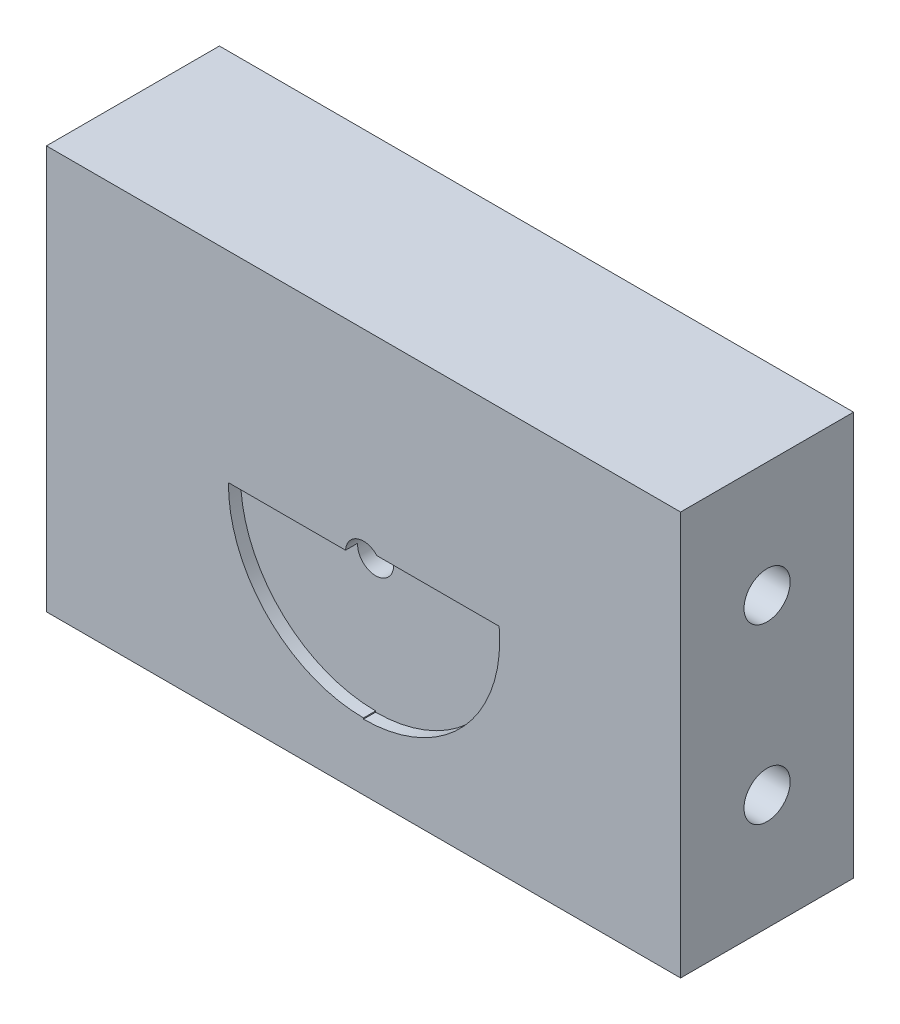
ISO-10303-21;
HEADER;
FILE_DESCRIPTION(('STEP AP214'),'2;1');
FILE_NAME('part.step','',(''),(''),'','','');
FILE_SCHEMA(('AUTOMOTIVE_DESIGN { 1 0 10303 214 1 1 1 1 }'));
ENDSEC;
DATA;
#1=APPLICATION_CONTEXT('core data for automotive mechanical design processes');
#2=APPLICATION_PROTOCOL_DEFINITION('international standard','automotive_design',2000,#1);
#3=PRODUCT_CONTEXT('',#1,'mechanical');
#4=PRODUCT('Part','Part','',(#3));
#5=PRODUCT_RELATED_PRODUCT_CATEGORY('part','',(#4));
#6=PRODUCT_DEFINITION_FORMATION('','',#4);
#7=PRODUCT_DEFINITION_CONTEXT('part definition',#1,'design');
#8=PRODUCT_DEFINITION('design','',#6,#7);
#9=PRODUCT_DEFINITION_SHAPE('','',#8);
#10=(LENGTH_UNIT() NAMED_UNIT(*) SI_UNIT(.MILLI.,.METRE.));
#11=(NAMED_UNIT(*) PLANE_ANGLE_UNIT() SI_UNIT($,.RADIAN.));
#12=(NAMED_UNIT(*) SI_UNIT($,.STERADIAN.) SOLID_ANGLE_UNIT());
#13=UNCERTAINTY_MEASURE_WITH_UNIT(LENGTH_MEASURE(1.E-05),#10,'distance_accuracy_value','');
#14=(GEOMETRIC_REPRESENTATION_CONTEXT(3) GLOBAL_UNCERTAINTY_ASSIGNED_CONTEXT((#13)) GLOBAL_UNIT_ASSIGNED_CONTEXT((#10,
#11,#12)) REPRESENTATION_CONTEXT('',''));
#15=CARTESIAN_POINT('',(0.,0.,0.));
#16=DIRECTION('',(0.,0.,1.));
#17=DIRECTION('',(1.,0.,0.));
#18=AXIS2_PLACEMENT_3D('',#15,#16,#17);
#19=CARTESIAN_POINT('',(0.360795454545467,0.,-6.35));
#20=DIRECTION('',(0.,0.,1.));
#21=DIRECTION('',(1.,0.,0.));
#22=AXIS2_PLACEMENT_3D('',#19,#20,#21);
#23=PLANE('',#22);
#24=CARTESIAN_POINT('',(0.,0.,-6.35000000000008));
#25=DIRECTION('',(0.,0.,-1.));
#26=DIRECTION('',(-1.,0.,0.));
#27=AXIS2_PLACEMENT_3D('',#24,#25,#26);
#28=CIRCLE('',#27,3.96875000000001);
#29=CARTESIAN_POINT('',(-3.96875000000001,0.,-6.35000000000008));
#30=VERTEX_POINT('',#29);
#31=EDGE_CURVE('E152',#30,#30,#28,.F.);
#32=ORIENTED_EDGE('',*,*,#31,.T.);
#33=EDGE_LOOP('',(#32));
#34=FACE_BOUND('',#33,.T.);
#35=ADVANCED_FACE('F33',(#34),#23,.T.);
#36=CARTESIAN_POINT('',(-67.31,0.386772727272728,7.62));
#37=DIRECTION('',(1.,0.,0.));
#38=DIRECTION('',(0.,0.,-1.));
#39=AXIS2_PLACEMENT_3D('',#36,#37,#38);
#40=PLANE('',#39);
#41=CARTESIAN_POINT('',(-67.31,0.,7.62));
#42=DIRECTION('',(1.,0.,0.));
#43=DIRECTION('',(0.,0.,-1.));
#44=AXIS2_PLACEMENT_3D('',#41,#42,#43);
#45=CIRCLE('',#44,4.25450000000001);
#46=CARTESIAN_POINT('',(-67.31,0.,3.36549999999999));
#47=VERTEX_POINT('',#46);
#48=EDGE_CURVE('E290',#47,#47,#45,.F.);
#49=ORIENTED_EDGE('',*,*,#48,.T.);
#50=EDGE_LOOP('',(#49));
#51=FACE_BOUND('',#50,.T.);
#52=ADVANCED_FACE('F319',(#51),#40,.F.);
#53=CARTESIAN_POINT('',(-65.278,-9.80209090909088,0.));
#54=DIRECTION('',(1.,0.,0.));
#55=DIRECTION('',(0.,0.,-1.));
#56=AXIS2_PLACEMENT_3D('',#53,#54,#55);
#57=PLANE('',#56);
#58=CARTESIAN_POINT('',(-65.278,-10.16,0.));
#59=DIRECTION('',(1.,0.,0.));
#60=DIRECTION('',(0.,0.,-1.));
#61=AXIS2_PLACEMENT_3D('',#58,#59,#60);
#62=CIRCLE('',#61,3.93700000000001);
#63=CARTESIAN_POINT('',(-65.278,-10.16,-3.93700000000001));
#64=VERTEX_POINT('',#63);
#65=EDGE_CURVE('E287',#64,#64,#62,.F.);
#66=ORIENTED_EDGE('',*,*,#65,.T.);
#67=EDGE_LOOP('',(#66));
#68=FACE_BOUND('',#67,.T.);
#69=ADVANCED_FACE('F324',(#68),#57,.F.);
#70=CARTESIAN_POINT('',(-65.278,10.5179090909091,0.));
#71=DIRECTION('',(1.,0.,0.));
#72=DIRECTION('',(0.,0.,-1.));
#73=AXIS2_PLACEMENT_3D('',#70,#71,#72);
#74=PLANE('',#73);
#75=CARTESIAN_POINT('',(-65.278,10.16,0.));
#76=DIRECTION('',(1.,0.,0.));
#77=DIRECTION('',(0.,0.,-1.));
#78=AXIS2_PLACEMENT_3D('',#75,#76,#77);
#79=CIRCLE('',#78,3.93700000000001);
#80=CARTESIAN_POINT('',(-65.278,10.16,-3.93700000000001));
#81=VERTEX_POINT('',#80);
#82=EDGE_CURVE('E284',#81,#81,#79,.F.);
#83=ORIENTED_EDGE('',*,*,#82,.T.);
#84=EDGE_LOOP('',(#83));
#85=FACE_BOUND('',#84,.T.);
#86=ADVANCED_FACE('F729',(#85),#74,.F.);
#87=CARTESIAN_POINT('',(-67.31,0.386772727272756,-7.62));
#88=DIRECTION('',(1.,0.,0.));
#89=DIRECTION('',(0.,0.,-1.));
#90=AXIS2_PLACEMENT_3D('',#87,#88,#89);
#91=PLANE('',#90);
#92=CARTESIAN_POINT('',(-67.31,0.,-7.62));
#93=DIRECTION('',(1.,0.,0.));
#94=DIRECTION('',(0.,0.,-1.));
#95=AXIS2_PLACEMENT_3D('',#92,#93,#94);
#96=CIRCLE('',#95,4.25450000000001);
#97=CARTESIAN_POINT('',(-67.31,0.,-11.8745));
#98=VERTEX_POINT('',#97);
#99=EDGE_CURVE('E281',#98,#98,#96,.F.);
#100=ORIENTED_EDGE('',*,*,#99,.T.);
#101=EDGE_LOOP('',(#100));
#102=FACE_BOUND('',#101,.T.);
#103=ADVANCED_FACE('F720',(#102),#91,.F.);
#104=CARTESIAN_POINT('',(-67.31,-39.3007272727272,5.08000000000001));
#105=DIRECTION('',(1.,0.,0.));
#106=DIRECTION('',(0.,0.,-1.));
#107=AXIS2_PLACEMENT_3D('',#104,#105,#106);
#108=PLANE('',#107);
#109=CARTESIAN_POINT('',(-67.31,-39.6875,5.08000000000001));
#110=DIRECTION('',(1.,0.,0.));
#111=DIRECTION('',(0.,0.,-1.));
#112=AXIS2_PLACEMENT_3D('',#109,#110,#111);
#113=CIRCLE('',#112,4.25450000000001);
#114=CARTESIAN_POINT('',(-67.31,-39.6875,0.825500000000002));
#115=VERTEX_POINT('',#114);
#116=EDGE_CURVE('E278',#115,#115,#113,.F.);
#117=ORIENTED_EDGE('',*,*,#116,.T.);
#118=EDGE_LOOP('',(#117));
#119=FACE_BOUND('',#118,.T.);
#120=ADVANCED_FACE('F621',(#119),#108,.F.);
#121=CARTESIAN_POINT('',(-67.31,40.0742727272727,5.08000000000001));
#122=DIRECTION('',(1.,0.,0.));
#123=DIRECTION('',(0.,0.,-1.));
#124=AXIS2_PLACEMENT_3D('',#121,#122,#123);
#125=PLANE('',#124);
#126=CARTESIAN_POINT('',(-67.31,39.6875,5.08000000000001));
#127=DIRECTION('',(1.,0.,0.));
#128=DIRECTION('',(0.,0.,-1.));
#129=AXIS2_PLACEMENT_3D('',#126,#127,#128);
#130=CIRCLE('',#129,4.25450000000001);
#131=CARTESIAN_POINT('',(-67.31,39.6875,0.825500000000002));
#132=VERTEX_POINT('',#131);
#133=EDGE_CURVE('E275',#132,#132,#130,.F.);
#134=ORIENTED_EDGE('',*,*,#133,.T.);
#135=EDGE_LOOP('',(#134));
#136=FACE_BOUND('',#135,.T.);
#137=ADVANCED_FACE('F603',(#136),#125,.F.);
#138=CARTESIAN_POINT('',(-67.31,40.0742727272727,-5.08));
#139=DIRECTION('',(1.,0.,0.));
#140=DIRECTION('',(0.,0.,-1.));
#141=AXIS2_PLACEMENT_3D('',#138,#139,#140);
#142=PLANE('',#141);
#143=CARTESIAN_POINT('',(-67.31,39.6875,-5.08));
#144=DIRECTION('',(1.,0.,0.));
#145=DIRECTION('',(0.,0.,-1.));
#146=AXIS2_PLACEMENT_3D('',#143,#144,#145);
#147=CIRCLE('',#146,4.25450000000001);
#148=CARTESIAN_POINT('',(-67.31,39.6875,-9.33450000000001));
#149=VERTEX_POINT('',#148);
#150=EDGE_CURVE('E272',#149,#149,#147,.F.);
#151=ORIENTED_EDGE('',*,*,#150,.T.);
#152=EDGE_LOOP('',(#151));
#153=FACE_BOUND('',#152,.T.);
#154=ADVANCED_FACE('F598',(#153),#142,.F.);
#155=CARTESIAN_POINT('',(-67.31,-39.3007272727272,-5.08));
#156=DIRECTION('',(1.,0.,0.));
#157=DIRECTION('',(0.,0.,-1.));
#158=AXIS2_PLACEMENT_3D('',#155,#156,#157);
#159=PLANE('',#158);
#160=CARTESIAN_POINT('',(-67.31,-39.6875,-5.08));
#161=DIRECTION('',(1.,0.,0.));
#162=DIRECTION('',(0.,0.,-1.));
#163=AXIS2_PLACEMENT_3D('',#160,#161,#162);
#164=CIRCLE('',#163,4.25450000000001);
#165=CARTESIAN_POINT('',(-67.31,-39.6875,-9.33450000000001));
#166=VERTEX_POINT('',#165);
#167=EDGE_CURVE('E269',#166,#166,#164,.F.);
#168=ORIENTED_EDGE('',*,*,#167,.T.);
#169=EDGE_LOOP('',(#168));
#170=FACE_BOUND('',#169,.T.);
#171=ADVANCED_FACE('F348',(#170),#159,.F.);
#172=CARTESIAN_POINT('',(-66.802,-27.94,5.1816));
#173=DIRECTION('',(1.,0.,0.));
#174=DIRECTION('',(0.,0.,-1.));
#175=AXIS2_PLACEMENT_3D('',#172,#173,#174);
#176=PLANE('',#175);
#177=CARTESIAN_POINT('',(-66.802,-22.86,0.));
#178=DIRECTION('',(1.,0.,0.));
#179=DIRECTION('',(0.,0.,-1.));
#180=AXIS2_PLACEMENT_3D('',#177,#178,#179);
#181=CIRCLE('',#180,5.08);
#182=CARTESIAN_POINT('',(-66.802,-22.86,-5.08));
#183=VERTEX_POINT('',#182);
#184=EDGE_CURVE('E266',#183,#183,#181,.F.);
#185=ORIENTED_EDGE('',*,*,#184,.T.);
#186=EDGE_LOOP('',(#185));
#187=FACE_BOUND('',#186,.T.);
#188=ADVANCED_FACE('F345',(#187),#176,.F.);
#189=CARTESIAN_POINT('',(-66.802,23.3218181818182,0.));
#190=DIRECTION('',(1.,0.,0.));
#191=DIRECTION('',(0.,0.,-1.));
#192=AXIS2_PLACEMENT_3D('',#189,#190,#191);
#193=PLANE('',#192);
#194=CARTESIAN_POINT('',(-66.802,22.86,0.));
#195=DIRECTION('',(1.,0.,0.));
#196=DIRECTION('',(0.,0.,-1.));
#197=AXIS2_PLACEMENT_3D('',#194,#195,#196);
#198=CIRCLE('',#197,5.08);
#199=CARTESIAN_POINT('',(-66.802,22.86,-5.08));
#200=VERTEX_POINT('',#199);
#201=EDGE_CURVE('E263',#200,#200,#198,.F.);
#202=ORIENTED_EDGE('',*,*,#201,.T.);
#203=EDGE_LOOP('',(#202));
#204=FACE_BOUND('',#203,.T.);
#205=ADVANCED_FACE('F314',(#204),#193,.F.);
#206=CARTESIAN_POINT('',(0.,0.,19.05));
#207=DIRECTION('',(0.,0.,-1.));
#208=DIRECTION('',(-1.,0.,0.));
#209=AXIS2_PLACEMENT_3D('',#206,#207,#208);
#210=CYLINDRICAL_SURFACE('',#209,3.96875000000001);
#211=CARTESIAN_POINT('',(0.,0.,19.05));
#212=DIRECTION('',(0.,0.,-1.));
#213=DIRECTION('',(-1.,0.,0.));
#214=AXIS2_PLACEMENT_3D('',#211,#212,#213);
#215=CIRCLE('',#214,3.96875000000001);
#216=CARTESIAN_POINT('',(-3.96061365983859,0.253999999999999,19.05));
#217=VERTEX_POINT('',#216);
#218=CARTESIAN_POINT('',(2.93906236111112,2.667,19.05));
#219=VERTEX_POINT('',#218);
#220=EDGE_CURVE('E261',#217,#219,#215,.T.);
#221=ORIENTED_EDGE('',*,*,#220,.F.);
#222=DIRECTION('',(0.,0.,-1.));
#223=VECTOR('',#222,1.);
#224=CARTESIAN_POINT('',(-3.96061365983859,0.253999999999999,19.05));
#225=LINE('',#224,#223);
#226=CARTESIAN_POINT('',(-3.96061365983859,0.253999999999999,16.383));
#227=VERTEX_POINT('',#226);
#228=EDGE_CURVE('E125',#217,#227,#225,.T.);
#229=ORIENTED_EDGE('',*,*,#228,.T.);
#230=CARTESIAN_POINT('',(0.,0.,16.383));
#231=DIRECTION('',(0.,0.,1.));
#232=DIRECTION('',(1.,0.,0.));
#233=AXIS2_PLACEMENT_3D('',#230,#231,#232);
#234=CIRCLE('',#233,3.96875000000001);
#235=CARTESIAN_POINT('',(2.93906236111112,2.667,16.383));
#236=VERTEX_POINT('',#235);
#237=EDGE_CURVE('E41',#236,#227,#234,.F.);
#238=ORIENTED_EDGE('',*,*,#237,.F.);
#239=DIRECTION('',(0.,0.,-1.));
#240=VECTOR('',#239,1.);
#241=CARTESIAN_POINT('',(2.93906236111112,2.667,19.05));
#242=LINE('',#241,#240);
#243=EDGE_CURVE('E148',#236,#219,#242,.F.);
#244=ORIENTED_EDGE('',*,*,#243,.T.);
#245=EDGE_LOOP('',(#221,#229,#238,#244));
#246=FACE_BOUND('',#245,.T.);
#247=ORIENTED_EDGE('',*,*,#31,.F.);
#248=EDGE_LOOP('',(#247));
#249=FACE_BOUND('',#248,.T.);
#250=ADVANCED_FACE('F310',(#246,#249),#210,.F.);
#251=CARTESIAN_POINT('',(39.116,13.97,5.1816));
#252=DIRECTION('',(1.,0.,0.));
#253=DIRECTION('',(0.,0.,-1.));
#254=AXIS2_PLACEMENT_3D('',#251,#252,#253);
#255=PLANE('',#254);
#256=CARTESIAN_POINT('',(39.116,19.05,0.));
#257=DIRECTION('',(-1.,0.,0.));
#258=DIRECTION('',(0.,0.,1.));
#259=AXIS2_PLACEMENT_3D('',#256,#257,#258);
#260=CIRCLE('',#259,5.08);
#261=CARTESIAN_POINT('',(39.116,19.05,5.08));
#262=VERTEX_POINT('',#261);
#263=EDGE_CURVE('E258',#262,#262,#260,.F.);
#264=ORIENTED_EDGE('',*,*,#263,.T.);
#265=EDGE_LOOP('',(#264));
#266=FACE_BOUND('',#265,.T.);
#267=ADVANCED_FACE('F313',(#266),#255,.T.);
#268=CARTESIAN_POINT('',(39.116,-18.5881818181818,0.));
#269=DIRECTION('',(1.,0.,0.));
#270=DIRECTION('',(0.,0.,-1.));
#271=AXIS2_PLACEMENT_3D('',#268,#269,#270);
#272=PLANE('',#271);
#273=CARTESIAN_POINT('',(39.116,-19.05,0.));
#274=DIRECTION('',(-1.,0.,0.));
#275=DIRECTION('',(0.,0.,1.));
#276=AXIS2_PLACEMENT_3D('',#273,#274,#275);
#277=CIRCLE('',#276,5.08);
#278=CARTESIAN_POINT('',(39.116,-19.05,5.08));
#279=VERTEX_POINT('',#278);
#280=EDGE_CURVE('E156',#279,#279,#277,.F.);
#281=ORIENTED_EDGE('',*,*,#280,.T.);
#282=EDGE_LOOP('',(#281));
#283=FACE_BOUND('',#282,.T.);
#284=ADVANCED_FACE('F351',(#283),#272,.T.);
#285=CARTESIAN_POINT('',(-69.85,0.,7.62));
#286=DIRECTION('',(1.,0.,0.));
#287=DIRECTION('',(0.,0.,-1.));
#288=AXIS2_PLACEMENT_3D('',#285,#286,#287);
#289=CYLINDRICAL_SURFACE('',#288,4.25450000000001);
#290=CARTESIAN_POINT('',(-69.85,0.,7.62));
#291=DIRECTION('',(1.,0.,0.));
#292=DIRECTION('',(0.,0.,-1.));
#293=AXIS2_PLACEMENT_3D('',#290,#291,#292);
#294=CIRCLE('',#293,4.25450000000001);
#295=CARTESIAN_POINT('',(-69.85,0.,3.36549999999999));
#296=VERTEX_POINT('',#295);
#297=EDGE_CURVE('E159',#296,#296,#294,.T.);
#298=ORIENTED_EDGE('',*,*,#297,.F.);
#299=EDGE_LOOP('',(#298));
#300=FACE_BOUND('',#299,.T.);
#301=ORIENTED_EDGE('',*,*,#48,.F.);
#302=EDGE_LOOP('',(#301));
#303=FACE_BOUND('',#302,.T.);
#304=ADVANCED_FACE('F522',(#300,#303),#289,.F.);
#305=CARTESIAN_POINT('',(-69.85,-10.16,0.));
#306=DIRECTION('',(1.,0.,0.));
#307=DIRECTION('',(0.,0.,-1.));
#308=AXIS2_PLACEMENT_3D('',#305,#306,#307);
#309=CYLINDRICAL_SURFACE('',#308,3.93700000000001);
#310=CARTESIAN_POINT('',(-69.85,-10.16,0.));
#311=DIRECTION('',(1.,0.,0.));
#312=DIRECTION('',(0.,0.,-1.));
#313=AXIS2_PLACEMENT_3D('',#310,#311,#312);
#314=CIRCLE('',#313,3.93700000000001);
#315=CARTESIAN_POINT('',(-69.85,-10.16,-3.93700000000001));
#316=VERTEX_POINT('',#315);
#317=EDGE_CURVE('E251',#316,#316,#314,.T.);
#318=ORIENTED_EDGE('',*,*,#317,.F.);
#319=EDGE_LOOP('',(#318));
#320=FACE_BOUND('',#319,.T.);
#321=ORIENTED_EDGE('',*,*,#65,.F.);
#322=EDGE_LOOP('',(#321));
#323=FACE_BOUND('',#322,.T.);
#324=ADVANCED_FACE('F527',(#320,#323),#309,.F.);
#325=CARTESIAN_POINT('',(-69.85,10.16,0.));
#326=DIRECTION('',(1.,0.,0.));
#327=DIRECTION('',(0.,0.,-1.));
#328=AXIS2_PLACEMENT_3D('',#325,#326,#327);
#329=CYLINDRICAL_SURFACE('',#328,3.93700000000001);
#330=CARTESIAN_POINT('',(-69.85,10.16,0.));
#331=DIRECTION('',(1.,0.,0.));
#332=DIRECTION('',(0.,0.,-1.));
#333=AXIS2_PLACEMENT_3D('',#330,#331,#332);
#334=CIRCLE('',#333,3.93700000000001);
#335=CARTESIAN_POINT('',(-69.85,10.16,-3.93700000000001));
#336=VERTEX_POINT('',#335);
#337=EDGE_CURVE('E248',#336,#336,#334,.T.);
#338=ORIENTED_EDGE('',*,*,#337,.F.);
#339=EDGE_LOOP('',(#338));
#340=FACE_BOUND('',#339,.T.);
#341=ORIENTED_EDGE('',*,*,#82,.F.);
#342=EDGE_LOOP('',(#341));
#343=FACE_BOUND('',#342,.T.);
#344=ADVANCED_FACE('F537',(#340,#343),#329,.F.);
#345=CARTESIAN_POINT('',(-69.85,0.,-7.62));
#346=DIRECTION('',(1.,0.,0.));
#347=DIRECTION('',(0.,0.,-1.));
#348=AXIS2_PLACEMENT_3D('',#345,#346,#347);
#349=CYLINDRICAL_SURFACE('',#348,4.25450000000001);
#350=CARTESIAN_POINT('',(-69.85,0.,-7.62));
#351=DIRECTION('',(1.,0.,0.));
#352=DIRECTION('',(0.,0.,-1.));
#353=AXIS2_PLACEMENT_3D('',#350,#351,#352);
#354=CIRCLE('',#353,4.25450000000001);
#355=CARTESIAN_POINT('',(-69.85,0.,-11.8745));
#356=VERTEX_POINT('',#355);
#357=EDGE_CURVE('E245',#356,#356,#354,.T.);
#358=ORIENTED_EDGE('',*,*,#357,.F.);
#359=EDGE_LOOP('',(#358));
#360=FACE_BOUND('',#359,.T.);
#361=ORIENTED_EDGE('',*,*,#99,.F.);
#362=EDGE_LOOP('',(#361));
#363=FACE_BOUND('',#362,.T.);
#364=ADVANCED_FACE('F555',(#360,#363),#349,.F.);
#365=CARTESIAN_POINT('',(-69.85,-39.6875,5.08000000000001));
#366=DIRECTION('',(1.,0.,0.));
#367=DIRECTION('',(0.,0.,-1.));
#368=AXIS2_PLACEMENT_3D('',#365,#366,#367);
#369=CYLINDRICAL_SURFACE('',#368,4.25450000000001);
#370=CARTESIAN_POINT('',(-69.85,-39.6875,5.08000000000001));
#371=DIRECTION('',(1.,0.,0.));
#372=DIRECTION('',(0.,0.,-1.));
#373=AXIS2_PLACEMENT_3D('',#370,#371,#372);
#374=CIRCLE('',#373,4.25450000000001);
#375=CARTESIAN_POINT('',(-69.85,-39.6875,0.825500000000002));
#376=VERTEX_POINT('',#375);
#377=EDGE_CURVE('E242',#376,#376,#374,.T.);
#378=ORIENTED_EDGE('',*,*,#377,.F.);
#379=EDGE_LOOP('',(#378));
#380=FACE_BOUND('',#379,.T.);
#381=ORIENTED_EDGE('',*,*,#116,.F.);
#382=EDGE_LOOP('',(#381));
#383=FACE_BOUND('',#382,.T.);
#384=ADVANCED_FACE('F565',(#380,#383),#369,.F.);
#385=CARTESIAN_POINT('',(-69.85,39.6875,5.08000000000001));
#386=DIRECTION('',(1.,0.,0.));
#387=DIRECTION('',(0.,0.,-1.));
#388=AXIS2_PLACEMENT_3D('',#385,#386,#387);
#389=CYLINDRICAL_SURFACE('',#388,4.25450000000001);
#390=CARTESIAN_POINT('',(-69.85,39.6875,5.08000000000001));
#391=DIRECTION('',(1.,0.,0.));
#392=DIRECTION('',(0.,0.,-1.));
#393=AXIS2_PLACEMENT_3D('',#390,#391,#392);
#394=CIRCLE('',#393,4.25450000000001);
#395=CARTESIAN_POINT('',(-69.85,39.6875,0.825500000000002));
#396=VERTEX_POINT('',#395);
#397=EDGE_CURVE('E239',#396,#396,#394,.T.);
#398=ORIENTED_EDGE('',*,*,#397,.F.);
#399=EDGE_LOOP('',(#398));
#400=FACE_BOUND('',#399,.T.);
#401=ORIENTED_EDGE('',*,*,#133,.F.);
#402=EDGE_LOOP('',(#401));
#403=FACE_BOUND('',#402,.T.);
#404=ADVANCED_FACE('F575',(#400,#403),#389,.F.);
#405=CARTESIAN_POINT('',(-69.85,39.6875,-5.08));
#406=DIRECTION('',(1.,0.,0.));
#407=DIRECTION('',(0.,0.,-1.));
#408=AXIS2_PLACEMENT_3D('',#405,#406,#407);
#409=CYLINDRICAL_SURFACE('',#408,4.25450000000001);
#410=CARTESIAN_POINT('',(-69.85,39.6875,-5.08));
#411=DIRECTION('',(1.,0.,0.));
#412=DIRECTION('',(0.,0.,-1.));
#413=AXIS2_PLACEMENT_3D('',#410,#411,#412);
#414=CIRCLE('',#413,4.25450000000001);
#415=CARTESIAN_POINT('',(-69.85,39.6875,-9.33450000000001));
#416=VERTEX_POINT('',#415);
#417=EDGE_CURVE('E236',#416,#416,#414,.T.);
#418=ORIENTED_EDGE('',*,*,#417,.F.);
#419=EDGE_LOOP('',(#418));
#420=FACE_BOUND('',#419,.T.);
#421=ORIENTED_EDGE('',*,*,#150,.F.);
#422=EDGE_LOOP('',(#421));
#423=FACE_BOUND('',#422,.T.);
#424=ADVANCED_FACE('F364',(#420,#423),#409,.F.);
#425=CARTESIAN_POINT('',(-69.85,-39.6875,-5.08));
#426=DIRECTION('',(1.,0.,0.));
#427=DIRECTION('',(0.,0.,-1.));
#428=AXIS2_PLACEMENT_3D('',#425,#426,#427);
#429=CYLINDRICAL_SURFACE('',#428,4.25450000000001);
#430=CARTESIAN_POINT('',(-69.85,-39.6875,-5.08));
#431=DIRECTION('',(1.,0.,0.));
#432=DIRECTION('',(0.,0.,-1.));
#433=AXIS2_PLACEMENT_3D('',#430,#431,#432);
#434=CIRCLE('',#433,4.25450000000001);
#435=CARTESIAN_POINT('',(-69.85,-39.6875,-9.33450000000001));
#436=VERTEX_POINT('',#435);
#437=EDGE_CURVE('E233',#436,#436,#434,.T.);
#438=ORIENTED_EDGE('',*,*,#437,.F.);
#439=EDGE_LOOP('',(#438));
#440=FACE_BOUND('',#439,.T.);
#441=ORIENTED_EDGE('',*,*,#167,.F.);
#442=EDGE_LOOP('',(#441));
#443=FACE_BOUND('',#442,.T.);
#444=ADVANCED_FACE('F356',(#440,#443),#429,.F.);
#445=CARTESIAN_POINT('',(-69.85,-22.86,0.));
#446=DIRECTION('',(1.,0.,0.));
#447=DIRECTION('',(0.,0.,-1.));
#448=AXIS2_PLACEMENT_3D('',#445,#446,#447);
#449=CYLINDRICAL_SURFACE('',#448,5.08);
#450=ORIENTED_EDGE('',*,*,#184,.F.);
#451=EDGE_LOOP('',(#450));
#452=FACE_BOUND('',#451,.T.);
#453=CARTESIAN_POINT('',(-69.85,-22.86,0.));
#454=DIRECTION('',(1.,0.,0.));
#455=DIRECTION('',(0.,0.,-1.));
#456=AXIS2_PLACEMENT_3D('',#453,#454,#455);
#457=CIRCLE('',#456,5.08);
#458=CARTESIAN_POINT('',(-69.85,-22.86,-5.08));
#459=VERTEX_POINT('',#458);
#460=EDGE_CURVE('E230',#459,#459,#457,.T.);
#461=ORIENTED_EDGE('',*,*,#460,.F.);
#462=EDGE_LOOP('',(#461));
#463=FACE_BOUND('',#462,.T.);
#464=ADVANCED_FACE('F353',(#452,#463),#449,.F.);
#465=CARTESIAN_POINT('',(-69.85,22.86,0.));
#466=DIRECTION('',(1.,0.,0.));
#467=DIRECTION('',(0.,0.,-1.));
#468=AXIS2_PLACEMENT_3D('',#465,#466,#467);
#469=CYLINDRICAL_SURFACE('',#468,5.08);
#470=ORIENTED_EDGE('',*,*,#201,.F.);
#471=EDGE_LOOP('',(#470));
#472=FACE_BOUND('',#471,.T.);
#473=CARTESIAN_POINT('',(-69.85,22.86,0.));
#474=DIRECTION('',(1.,0.,0.));
#475=DIRECTION('',(0.,0.,-1.));
#476=AXIS2_PLACEMENT_3D('',#473,#474,#475);
#477=CIRCLE('',#476,5.08);
#478=CARTESIAN_POINT('',(-69.85,22.86,-5.08));
#479=VERTEX_POINT('',#478);
#480=EDGE_CURVE('E166',#479,#479,#477,.T.);
#481=ORIENTED_EDGE('',*,*,#480,.F.);
#482=EDGE_LOOP('',(#481));
#483=FACE_BOUND('',#482,.T.);
#484=ADVANCED_FACE('F355',(#472,#483),#469,.F.);
#485=CARTESIAN_POINT('',(0.,0.,19.05));
#486=DIRECTION('',(0.,0.,1.));
#487=DIRECTION('',(1.,0.,0.));
#488=AXIS2_PLACEMENT_3D('',#485,#486,#487);
#489=PLANE('',#488);
#490=CARTESIAN_POINT('',(0.,0.,19.05));
#491=DIRECTION('',(0.,0.,1.));
#492=DIRECTION('',(1.,0.,0.));
#493=AXIS2_PLACEMENT_3D('',#490,#491,#492);
#494=CIRCLE('',#493,29.7560228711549);
#495=CARTESIAN_POINT('',(-29.7549387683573,0.253999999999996,19.05));
#496=VERTEX_POINT('',#495);
#497=CARTESIAN_POINT('',(0.,-29.7560228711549,19.05));
#498=VERTEX_POINT('',#497);
#499=EDGE_CURVE('E116',#496,#498,#494,.T.);
#500=ORIENTED_EDGE('',*,*,#499,.F.);
#501=DIRECTION('',(-1.,0.,0.));
#502=VECTOR('',#501,1.);
#503=CARTESIAN_POINT('',(2.93906236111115,0.254,19.05));
#504=LINE('',#503,#502);
#505=EDGE_CURVE('E122',#217,#496,#504,.T.);
#506=ORIENTED_EDGE('',*,*,#505,.F.);
#507=ORIENTED_EDGE('',*,*,#220,.T.);
#508=DIRECTION('',(-1.,0.,0.));
#509=VECTOR('',#508,1.);
#510=CARTESIAN_POINT('',(0.,2.667,19.05));
#511=LINE('',#510,#509);
#512=CARTESIAN_POINT('',(29.8812166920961,2.667,19.05));
#513=VERTEX_POINT('',#512);
#514=EDGE_CURVE('E138',#513,#219,#511,.T.);
#515=ORIENTED_EDGE('',*,*,#514,.F.);
#516=CARTESIAN_POINT('',(0.,0.,19.05));
#517=DIRECTION('',(0.,0.,1.));
#518=DIRECTION('',(1.,0.,0.));
#519=AXIS2_PLACEMENT_3D('',#516,#517,#518);
#520=CIRCLE('',#519,30.);
#521=CARTESIAN_POINT('',(0.,-30.,19.05));
#522=VERTEX_POINT('',#521);
#523=EDGE_CURVE('E56',#522,#513,#520,.T.);
#524=ORIENTED_EDGE('',*,*,#523,.F.);
#525=DIRECTION('',(0.,-1.,0.));
#526=VECTOR('',#525,1.);
#527=CARTESIAN_POINT('',(0.,0.,19.05));
#528=LINE('',#527,#526);
#529=EDGE_CURVE('E191',#498,#522,#528,.T.);
#530=ORIENTED_EDGE('',*,*,#529,.F.);
#531=EDGE_LOOP('',(#500,#506,#507,#515,#524,#530));
#532=FACE_BOUND('',#531,.T.);
#533=DIRECTION('',(0.,1.,0.));
#534=VECTOR('',#533,1.);
#535=CARTESIAN_POINT('',(69.85,44.45,19.05));
#536=LINE('',#535,#534);
#537=CARTESIAN_POINT('',(69.85,44.45,19.05));
#538=VERTEX_POINT('',#537);
#539=CARTESIAN_POINT('',(69.85,-44.45,19.05));
#540=VERTEX_POINT('',#539);
#541=EDGE_CURVE('E163',#538,#540,#536,.F.);
#542=ORIENTED_EDGE('',*,*,#541,.F.);
#543=DIRECTION('',(1.,0.,0.));
#544=VECTOR('',#543,1.);
#545=CARTESIAN_POINT('',(-69.85,44.45,19.05));
#546=LINE('',#545,#544);
#547=CARTESIAN_POINT('',(-69.85,44.45,19.05));
#548=VERTEX_POINT('',#547);
#549=EDGE_CURVE('E153',#548,#538,#546,.T.);
#550=ORIENTED_EDGE('',*,*,#549,.F.);
#551=DIRECTION('',(0.,1.,0.));
#552=VECTOR('',#551,1.);
#553=CARTESIAN_POINT('',(-69.85,-44.45,19.05));
#554=LINE('',#553,#552);
#555=CARTESIAN_POINT('',(-69.85,-44.45,19.05));
#556=VERTEX_POINT('',#555);
#557=EDGE_CURVE('E155',#556,#548,#554,.T.);
#558=ORIENTED_EDGE('',*,*,#557,.F.);
#559=DIRECTION('',(1.,0.,0.));
#560=VECTOR('',#559,1.);
#561=CARTESIAN_POINT('',(69.85,-44.45,19.05));
#562=LINE('',#561,#560);
#563=EDGE_CURVE('E164',#540,#556,#562,.F.);
#564=ORIENTED_EDGE('',*,*,#563,.F.);
#565=EDGE_LOOP('',(#542,#550,#558,#564));
#566=FACE_BOUND('',#565,.T.);
#567=ADVANCED_FACE('F303',(#532,#566),#489,.T.);
#568=CARTESIAN_POINT('',(69.85,19.05,0.));
#569=DIRECTION('',(-1.,0.,0.));
#570=DIRECTION('',(0.,0.,1.));
#571=AXIS2_PLACEMENT_3D('',#568,#569,#570);
#572=CYLINDRICAL_SURFACE('',#571,5.08);
#573=ORIENTED_EDGE('',*,*,#263,.F.);
#574=EDGE_LOOP('',(#573));
#575=FACE_BOUND('',#574,.T.);
#576=CARTESIAN_POINT('',(69.85,19.05,0.));
#577=DIRECTION('',(-1.,0.,0.));
#578=DIRECTION('',(0.,0.,1.));
#579=AXIS2_PLACEMENT_3D('',#576,#577,#578);
#580=CIRCLE('',#579,5.08);
#581=CARTESIAN_POINT('',(69.85,19.05,5.08));
#582=VERTEX_POINT('',#581);
#583=EDGE_CURVE('E170',#582,#582,#580,.T.);
#584=ORIENTED_EDGE('',*,*,#583,.F.);
#585=EDGE_LOOP('',(#584));
#586=FACE_BOUND('',#585,.T.);
#587=ADVANCED_FACE('F35',(#575,#586),#572,.F.);
#588=CARTESIAN_POINT('',(69.85,-19.05,0.));
#589=DIRECTION('',(-1.,0.,0.));
#590=DIRECTION('',(0.,0.,1.));
#591=AXIS2_PLACEMENT_3D('',#588,#589,#590);
#592=CYLINDRICAL_SURFACE('',#591,5.08);
#593=ORIENTED_EDGE('',*,*,#280,.F.);
#594=EDGE_LOOP('',(#593));
#595=FACE_BOUND('',#594,.T.);
#596=CARTESIAN_POINT('',(69.85,-19.05,0.));
#597=DIRECTION('',(-1.,0.,0.));
#598=DIRECTION('',(0.,0.,1.));
#599=AXIS2_PLACEMENT_3D('',#596,#597,#598);
#600=CIRCLE('',#599,5.08);
#601=CARTESIAN_POINT('',(69.85,-19.05,5.08));
#602=VERTEX_POINT('',#601);
#603=EDGE_CURVE('E223',#602,#602,#600,.T.);
#604=ORIENTED_EDGE('',*,*,#603,.F.);
#605=EDGE_LOOP('',(#604));
#606=FACE_BOUND('',#605,.T.);
#607=ADVANCED_FACE('F415',(#595,#606),#592,.F.);
#608=CARTESIAN_POINT('',(-37.7392045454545,38.1,-0.1524));
#609=DIRECTION('',(0.,0.,1.));
#610=DIRECTION('',(1.,0.,0.));
#611=AXIS2_PLACEMENT_3D('',#608,#609,#610);
#612=PLANE('',#611);
#613=CARTESIAN_POINT('',(-38.1,38.1,-0.1524));
#614=DIRECTION('',(0.,0.,-1.));
#615=DIRECTION('',(-1.,0.,0.));
#616=AXIS2_PLACEMENT_3D('',#613,#614,#615);
#617=CIRCLE('',#616,3.96875);
#618=CARTESIAN_POINT('',(-42.06875,38.1,-0.1524));
#619=VERTEX_POINT('',#618);
#620=EDGE_CURVE('E220',#619,#619,#617,.T.);
#621=ORIENTED_EDGE('',*,*,#620,.T.);
#622=EDGE_LOOP('',(#621));
#623=FACE_BOUND('',#622,.T.);
#624=ADVANCED_FACE('F420',(#623),#612,.F.);
#625=CARTESIAN_POINT('',(38.4607954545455,38.1,-0.1524));
#626=DIRECTION('',(0.,0.,1.));
#627=DIRECTION('',(1.,0.,0.));
#628=AXIS2_PLACEMENT_3D('',#625,#626,#627);
#629=PLANE('',#628);
#630=CARTESIAN_POINT('',(38.1,38.1,-0.1524));
#631=DIRECTION('',(0.,0.,-1.));
#632=DIRECTION('',(-1.,0.,0.));
#633=AXIS2_PLACEMENT_3D('',#630,#631,#632);
#634=CIRCLE('',#633,3.96875);
#635=CARTESIAN_POINT('',(34.13125,38.1,-0.1524));
#636=VERTEX_POINT('',#635);
#637=EDGE_CURVE('E217',#636,#636,#634,.T.);
#638=ORIENTED_EDGE('',*,*,#637,.T.);
#639=EDGE_LOOP('',(#638));
#640=FACE_BOUND('',#639,.T.);
#641=ADVANCED_FACE('F424',(#640),#629,.F.);
#642=CARTESIAN_POINT('',(-37.7392045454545,-38.1,-0.1524));
#643=DIRECTION('',(0.,0.,1.));
#644=DIRECTION('',(1.,0.,0.));
#645=AXIS2_PLACEMENT_3D('',#642,#643,#644);
#646=PLANE('',#645);
#647=CARTESIAN_POINT('',(-38.1,-38.1,-0.1524));
#648=DIRECTION('',(0.,0.,-1.));
#649=DIRECTION('',(-1.,0.,0.));
#650=AXIS2_PLACEMENT_3D('',#647,#648,#649);
#651=CIRCLE('',#650,3.96875);
#652=CARTESIAN_POINT('',(-42.06875,-38.1,-0.1524));
#653=VERTEX_POINT('',#652);
#654=EDGE_CURVE('E214',#653,#653,#651,.T.);
#655=ORIENTED_EDGE('',*,*,#654,.T.);
#656=EDGE_LOOP('',(#655));
#657=FACE_BOUND('',#656,.T.);
#658=ADVANCED_FACE('F428',(#657),#646,.F.);
#659=CARTESIAN_POINT('',(0.,0.,-3.5814));
#660=DIRECTION('',(0.,0.,1.));
#661=DIRECTION('',(1.,0.,0.));
#662=AXIS2_PLACEMENT_3D('',#659,#660,#661);
#663=PLANE('',#662);
#664=CARTESIAN_POINT('',(-38.1,0.,-3.5814));
#665=DIRECTION('',(0.,0.,-1.));
#666=DIRECTION('',(-1.,0.,0.));
#667=AXIS2_PLACEMENT_3D('',#664,#665,#666);
#668=CIRCLE('',#667,3.98145);
#669=CARTESIAN_POINT('',(-42.08145,0.,-3.5814));
#670=VERTEX_POINT('',#669);
#671=EDGE_CURVE('E211',#670,#670,#668,.T.);
#672=ORIENTED_EDGE('',*,*,#671,.T.);
#673=EDGE_LOOP('',(#672));
#674=FACE_BOUND('',#673,.T.);
#675=ADVANCED_FACE('F432',(#674),#663,.F.);
#676=CARTESIAN_POINT('',(38.4607954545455,-38.1,-0.1524));
#677=DIRECTION('',(0.,0.,1.));
#678=DIRECTION('',(1.,0.,0.));
#679=AXIS2_PLACEMENT_3D('',#676,#677,#678);
#680=PLANE('',#679);
#681=CARTESIAN_POINT('',(38.1,-38.1,-0.1524));
#682=DIRECTION('',(0.,0.,-1.));
#683=DIRECTION('',(-1.,0.,0.));
#684=AXIS2_PLACEMENT_3D('',#681,#682,#683);
#685=CIRCLE('',#684,3.96875);
#686=CARTESIAN_POINT('',(34.13125,-38.1,-0.1524));
#687=VERTEX_POINT('',#686);
#688=EDGE_CURVE('E187',#687,#687,#685,.T.);
#689=ORIENTED_EDGE('',*,*,#688,.T.);
#690=EDGE_LOOP('',(#689));
#691=FACE_BOUND('',#690,.T.);
#692=ADVANCED_FACE('F436',(#691),#680,.F.);
#693=CARTESIAN_POINT('',(-69.85,44.45,-3.5814));
#694=DIRECTION('',(0.,1.,0.));
#695=DIRECTION('',(0.,0.,1.));
#696=AXIS2_PLACEMENT_3D('',#693,#694,#695);
#697=PLANE('',#696);
#698=DIRECTION('',(1.,0.,0.));
#699=VECTOR('',#698,1.);
#700=CARTESIAN_POINT('',(0.,44.45,-19.05));
#701=LINE('',#700,#699);
#702=CARTESIAN_POINT('',(69.85,44.45,-19.05));
#703=VERTEX_POINT('',#702);
#704=CARTESIAN_POINT('',(-69.85,44.45,-19.05));
#705=VERTEX_POINT('',#704);
#706=EDGE_CURVE('E184',#703,#705,#701,.F.);
#707=ORIENTED_EDGE('',*,*,#706,.T.);
#708=DIRECTION('',(0.,0.,1.));
#709=VECTOR('',#708,1.);
#710=CARTESIAN_POINT('',(-69.85,44.45,-3.5814));
#711=LINE('',#710,#709);
#712=EDGE_CURVE('E157',#548,#705,#711,.F.);
#713=ORIENTED_EDGE('',*,*,#712,.F.);
#714=ORIENTED_EDGE('',*,*,#549,.T.);
#715=DIRECTION('',(0.,0.,-1.));
#716=VECTOR('',#715,1.);
#717=CARTESIAN_POINT('',(69.85,44.45,-3.5814));
#718=LINE('',#717,#716);
#719=EDGE_CURVE('E167',#703,#538,#718,.F.);
#720=ORIENTED_EDGE('',*,*,#719,.F.);
#721=EDGE_LOOP('',(#707,#713,#714,#720));
#722=FACE_BOUND('',#721,.T.);
#723=ADVANCED_FACE('F375',(#722),#697,.T.);
#724=CARTESIAN_POINT('',(-69.85,-44.45,-3.5814));
#725=DIRECTION('',(-1.,0.,0.));
#726=DIRECTION('',(0.,0.,1.));
#727=AXIS2_PLACEMENT_3D('',#724,#725,#726);
#728=PLANE('',#727);
#729=ORIENTED_EDGE('',*,*,#480,.T.);
#730=EDGE_LOOP('',(#729));
#731=FACE_BOUND('',#730,.T.);
#732=ORIENTED_EDGE('',*,*,#460,.T.);
#733=EDGE_LOOP('',(#732));
#734=FACE_BOUND('',#733,.T.);
#735=ORIENTED_EDGE('',*,*,#437,.T.);
#736=EDGE_LOOP('',(#735));
#737=FACE_BOUND('',#736,.T.);
#738=ORIENTED_EDGE('',*,*,#417,.T.);
#739=EDGE_LOOP('',(#738));
#740=FACE_BOUND('',#739,.T.);
#741=ORIENTED_EDGE('',*,*,#397,.T.);
#742=EDGE_LOOP('',(#741));
#743=FACE_BOUND('',#742,.T.);
#744=ORIENTED_EDGE('',*,*,#377,.T.);
#745=EDGE_LOOP('',(#744));
#746=FACE_BOUND('',#745,.T.);
#747=ORIENTED_EDGE('',*,*,#357,.T.);
#748=EDGE_LOOP('',(#747));
#749=FACE_BOUND('',#748,.T.);
#750=ORIENTED_EDGE('',*,*,#337,.T.);
#751=EDGE_LOOP('',(#750));
#752=FACE_BOUND('',#751,.T.);
#753=ORIENTED_EDGE('',*,*,#317,.T.);
#754=EDGE_LOOP('',(#753));
#755=FACE_BOUND('',#754,.T.);
#756=ORIENTED_EDGE('',*,*,#297,.T.);
#757=EDGE_LOOP('',(#756));
#758=FACE_BOUND('',#757,.T.);
#759=DIRECTION('',(0.,1.,0.));
#760=VECTOR('',#759,1.);
#761=CARTESIAN_POINT('',(-69.85,0.,-19.05));
#762=LINE('',#761,#760);
#763=CARTESIAN_POINT('',(-69.85,-44.45,-19.05));
#764=VERTEX_POINT('',#763);
#765=EDGE_CURVE('E181',#705,#764,#762,.F.);
#766=ORIENTED_EDGE('',*,*,#765,.T.);
#767=DIRECTION('',(0.,0.,-1.));
#768=VECTOR('',#767,1.);
#769=CARTESIAN_POINT('',(-69.85,-44.45,-3.5814));
#770=LINE('',#769,#768);
#771=EDGE_CURVE('E161',#556,#764,#770,.T.);
#772=ORIENTED_EDGE('',*,*,#771,.F.);
#773=ORIENTED_EDGE('',*,*,#557,.T.);
#774=ORIENTED_EDGE('',*,*,#712,.T.);
#775=EDGE_LOOP('',(#766,#772,#773,#774));
#776=FACE_BOUND('',#775,.T.);
#777=ADVANCED_FACE('F371',(#731,#734,#737,#740,#743,#746,#749,#752,#755,#758,#776),#728,.T.);
#778=CARTESIAN_POINT('',(69.85,-44.45,-3.5814));
#779=DIRECTION('',(0.,-1.,0.));
#780=DIRECTION('',(0.,0.,-1.));
#781=AXIS2_PLACEMENT_3D('',#778,#779,#780);
#782=PLANE('',#781);
#783=DIRECTION('',(1.,0.,0.));
#784=VECTOR('',#783,1.);
#785=CARTESIAN_POINT('',(0.,-44.45,-19.05));
#786=LINE('',#785,#784);
#787=CARTESIAN_POINT('',(69.85,-44.45,-19.05));
#788=VERTEX_POINT('',#787);
#789=EDGE_CURVE('E178',#764,#788,#786,.T.);
#790=ORIENTED_EDGE('',*,*,#789,.T.);
#791=DIRECTION('',(0.,0.,-1.));
#792=VECTOR('',#791,1.);
#793=CARTESIAN_POINT('',(69.85,-44.45,-3.5814));
#794=LINE('',#793,#792);
#795=EDGE_CURVE('E171',#540,#788,#794,.T.);
#796=ORIENTED_EDGE('',*,*,#795,.F.);
#797=ORIENTED_EDGE('',*,*,#563,.T.);
#798=ORIENTED_EDGE('',*,*,#771,.T.);
#799=EDGE_LOOP('',(#790,#796,#797,#798));
#800=FACE_BOUND('',#799,.T.);
#801=ADVANCED_FACE('F374',(#800),#782,.T.);
#802=CARTESIAN_POINT('',(69.85,44.45,-3.5814));
#803=DIRECTION('',(1.,0.,0.));
#804=DIRECTION('',(0.,0.,-1.));
#805=AXIS2_PLACEMENT_3D('',#802,#803,#804);
#806=PLANE('',#805);
#807=ORIENTED_EDGE('',*,*,#603,.T.);
#808=EDGE_LOOP('',(#807));
#809=FACE_BOUND('',#808,.T.);
#810=ORIENTED_EDGE('',*,*,#583,.T.);
#811=EDGE_LOOP('',(#810));
#812=FACE_BOUND('',#811,.T.);
#813=DIRECTION('',(0.,1.,0.));
#814=VECTOR('',#813,1.);
#815=CARTESIAN_POINT('',(69.85,0.,-19.05));
#816=LINE('',#815,#814);
#817=EDGE_CURVE('E174',#788,#703,#816,.T.);
#818=ORIENTED_EDGE('',*,*,#817,.T.);
#819=ORIENTED_EDGE('',*,*,#719,.T.);
#820=ORIENTED_EDGE('',*,*,#541,.T.);
#821=ORIENTED_EDGE('',*,*,#795,.T.);
#822=EDGE_LOOP('',(#818,#819,#820,#821));
#823=FACE_BOUND('',#822,.T.);
#824=ADVANCED_FACE('F405',(#809,#812,#823),#806,.T.);
#825=CARTESIAN_POINT('',(-38.1,38.1,-0.1524));
#826=DIRECTION('',(0.,0.,-1.));
#827=DIRECTION('',(-1.,0.,0.));
#828=AXIS2_PLACEMENT_3D('',#825,#826,#827);
#829=CYLINDRICAL_SURFACE('',#828,3.96875);
#830=CARTESIAN_POINT('',(-38.1,38.1,-19.05));
#831=DIRECTION('',(0.,0.,-1.));
#832=DIRECTION('',(-1.,0.,0.));
#833=AXIS2_PLACEMENT_3D('',#830,#831,#832);
#834=CIRCLE('',#833,3.96875);
#835=CARTESIAN_POINT('',(-42.06875,38.1,-19.05));
#836=VERTEX_POINT('',#835);
#837=EDGE_CURVE('E177',#836,#836,#834,.T.);
#838=ORIENTED_EDGE('',*,*,#837,.T.);
#839=EDGE_LOOP('',(#838));
#840=FACE_BOUND('',#839,.T.);
#841=ORIENTED_EDGE('',*,*,#620,.F.);
#842=EDGE_LOOP('',(#841));
#843=FACE_BOUND('',#842,.T.);
#844=ADVANCED_FACE('F447',(#840,#843),#829,.F.);
#845=CARTESIAN_POINT('',(38.1,38.1,-0.1524));
#846=DIRECTION('',(0.,0.,-1.));
#847=DIRECTION('',(-1.,0.,0.));
#848=AXIS2_PLACEMENT_3D('',#845,#846,#847);
#849=CYLINDRICAL_SURFACE('',#848,3.96875);
#850=CARTESIAN_POINT('',(38.1,38.1,-19.05));
#851=DIRECTION('',(0.,0.,-1.));
#852=DIRECTION('',(-1.,0.,0.));
#853=AXIS2_PLACEMENT_3D('',#850,#851,#852);
#854=CIRCLE('',#853,3.96875);
#855=CARTESIAN_POINT('',(34.13125,38.1,-19.05));
#856=VERTEX_POINT('',#855);
#857=EDGE_CURVE('E204',#856,#856,#854,.T.);
#858=ORIENTED_EDGE('',*,*,#857,.T.);
#859=EDGE_LOOP('',(#858));
#860=FACE_BOUND('',#859,.T.);
#861=ORIENTED_EDGE('',*,*,#637,.F.);
#862=EDGE_LOOP('',(#861));
#863=FACE_BOUND('',#862,.T.);
#864=ADVANCED_FACE('F451',(#860,#863),#849,.F.);
#865=CARTESIAN_POINT('',(-38.1,-38.1,-0.1524));
#866=DIRECTION('',(0.,0.,-1.));
#867=DIRECTION('',(-1.,0.,0.));
#868=AXIS2_PLACEMENT_3D('',#865,#866,#867);
#869=CYLINDRICAL_SURFACE('',#868,3.96875);
#870=CARTESIAN_POINT('',(-38.1,-38.1,-19.05));
#871=DIRECTION('',(0.,0.,-1.));
#872=DIRECTION('',(-1.,0.,0.));
#873=AXIS2_PLACEMENT_3D('',#870,#871,#872);
#874=CIRCLE('',#873,3.96875);
#875=CARTESIAN_POINT('',(-42.06875,-38.1,-19.05));
#876=VERTEX_POINT('',#875);
#877=EDGE_CURVE('E201',#876,#876,#874,.T.);
#878=ORIENTED_EDGE('',*,*,#877,.T.);
#879=EDGE_LOOP('',(#878));
#880=FACE_BOUND('',#879,.T.);
#881=ORIENTED_EDGE('',*,*,#654,.F.);
#882=EDGE_LOOP('',(#881));
#883=FACE_BOUND('',#882,.T.);
#884=ADVANCED_FACE('F455',(#880,#883),#869,.F.);
#885=CARTESIAN_POINT('',(-38.1,0.,-3.5814));
#886=DIRECTION('',(0.,0.,-1.));
#887=DIRECTION('',(-1.,0.,0.));
#888=AXIS2_PLACEMENT_3D('',#885,#886,#887);
#889=CYLINDRICAL_SURFACE('',#888,3.98145);
#890=CARTESIAN_POINT('',(-38.1,0.,-19.05));
#891=DIRECTION('',(0.,0.,-1.));
#892=DIRECTION('',(-1.,0.,0.));
#893=AXIS2_PLACEMENT_3D('',#890,#891,#892);
#894=CIRCLE('',#893,3.98145);
#895=CARTESIAN_POINT('',(-42.08145,0.,-19.05));
#896=VERTEX_POINT('',#895);
#897=EDGE_CURVE('E198',#896,#896,#894,.T.);
#898=ORIENTED_EDGE('',*,*,#897,.T.);
#899=EDGE_LOOP('',(#898));
#900=FACE_BOUND('',#899,.T.);
#901=ORIENTED_EDGE('',*,*,#671,.F.);
#902=EDGE_LOOP('',(#901));
#903=FACE_BOUND('',#902,.T.);
#904=ADVANCED_FACE('F459',(#900,#903),#889,.F.);
#905=CARTESIAN_POINT('',(38.1,-38.1,-0.1524));
#906=DIRECTION('',(0.,0.,-1.));
#907=DIRECTION('',(-1.,0.,0.));
#908=AXIS2_PLACEMENT_3D('',#905,#906,#907);
#909=CYLINDRICAL_SURFACE('',#908,3.96875);
#910=CARTESIAN_POINT('',(38.1,-38.1,-19.05));
#911=DIRECTION('',(0.,0.,-1.));
#912=DIRECTION('',(-1.,0.,0.));
#913=AXIS2_PLACEMENT_3D('',#910,#911,#912);
#914=CIRCLE('',#913,3.96875);
#915=CARTESIAN_POINT('',(34.13125,-38.1,-19.05));
#916=VERTEX_POINT('',#915);
#917=EDGE_CURVE('E195',#916,#916,#914,.T.);
#918=ORIENTED_EDGE('',*,*,#917,.T.);
#919=EDGE_LOOP('',(#918));
#920=FACE_BOUND('',#919,.T.);
#921=ORIENTED_EDGE('',*,*,#688,.F.);
#922=EDGE_LOOP('',(#921));
#923=FACE_BOUND('',#922,.T.);
#924=ADVANCED_FACE('F463',(#920,#923),#909,.F.);
#925=CARTESIAN_POINT('',(0.,0.,-3.5814));
#926=DIRECTION('',(0.,0.,1.));
#927=DIRECTION('',(1.,0.,0.));
#928=AXIS2_PLACEMENT_3D('',#925,#926,#927);
#929=PLANE('',#928);
#930=CARTESIAN_POINT('',(38.1,0.,-3.5814));
#931=DIRECTION('',(0.,0.,-1.));
#932=DIRECTION('',(-1.,0.,0.));
#933=AXIS2_PLACEMENT_3D('',#930,#931,#932);
#934=CIRCLE('',#933,3.98145);
#935=CARTESIAN_POINT('',(34.11855,0.,-3.5814));
#936=VERTEX_POINT('',#935);
#937=EDGE_CURVE('E192',#936,#936,#934,.T.);
#938=ORIENTED_EDGE('',*,*,#937,.T.);
#939=EDGE_LOOP('',(#938));
#940=FACE_BOUND('',#939,.T.);
#941=ADVANCED_FACE('F338',(#940),#929,.F.);
#942=CARTESIAN_POINT('',(0.,0.,-19.05));
#943=DIRECTION('',(0.,0.,1.));
#944=DIRECTION('',(1.,0.,0.));
#945=AXIS2_PLACEMENT_3D('',#942,#943,#944);
#946=PLANE('',#945);
#947=ORIENTED_EDGE('',*,*,#917,.F.);
#948=EDGE_LOOP('',(#947));
#949=FACE_BOUND('',#948,.T.);
#950=ORIENTED_EDGE('',*,*,#897,.F.);
#951=EDGE_LOOP('',(#950));
#952=FACE_BOUND('',#951,.T.);
#953=ORIENTED_EDGE('',*,*,#877,.F.);
#954=EDGE_LOOP('',(#953));
#955=FACE_BOUND('',#954,.T.);
#956=ORIENTED_EDGE('',*,*,#857,.F.);
#957=EDGE_LOOP('',(#956));
#958=FACE_BOUND('',#957,.T.);
#959=ORIENTED_EDGE('',*,*,#837,.F.);
#960=EDGE_LOOP('',(#959));
#961=FACE_BOUND('',#960,.T.);
#962=CARTESIAN_POINT('',(38.1,0.,-19.05));
#963=DIRECTION('',(0.,0.,-1.));
#964=DIRECTION('',(-1.,0.,0.));
#965=AXIS2_PLACEMENT_3D('',#962,#963,#964);
#966=CIRCLE('',#965,3.98145);
#967=CARTESIAN_POINT('',(34.11855,0.,-19.05));
#968=VERTEX_POINT('',#967);
#969=EDGE_CURVE('E188',#968,#968,#966,.F.);
#970=ORIENTED_EDGE('',*,*,#969,.T.);
#971=EDGE_LOOP('',(#970));
#972=FACE_BOUND('',#971,.T.);
#973=ORIENTED_EDGE('',*,*,#789,.F.);
#974=ORIENTED_EDGE('',*,*,#765,.F.);
#975=ORIENTED_EDGE('',*,*,#706,.F.);
#976=ORIENTED_EDGE('',*,*,#817,.F.);
#977=EDGE_LOOP('',(#973,#974,#975,#976));
#978=FACE_BOUND('',#977,.T.);
#979=ADVANCED_FACE('F332',(#949,#952,#955,#958,#961,#972,#978),#946,.F.);
#980=CARTESIAN_POINT('',(38.1,0.,-3.5814));
#981=DIRECTION('',(0.,0.,-1.));
#982=DIRECTION('',(-1.,0.,0.));
#983=AXIS2_PLACEMENT_3D('',#980,#981,#982);
#984=CYLINDRICAL_SURFACE('',#983,3.98145);
#985=ORIENTED_EDGE('',*,*,#969,.F.);
#986=EDGE_LOOP('',(#985));
#987=FACE_BOUND('',#986,.T.);
#988=ORIENTED_EDGE('',*,*,#937,.F.);
#989=EDGE_LOOP('',(#988));
#990=FACE_BOUND('',#989,.T.);
#991=ADVANCED_FACE('F329',(#987,#990),#984,.F.);
#992=CARTESIAN_POINT('',(0.,0.,16.383));
#993=DIRECTION('',(0.,0.,1.));
#994=DIRECTION('',(1.,0.,0.));
#995=AXIS2_PLACEMENT_3D('',#992,#993,#994);
#996=PLANE('',#995);
#997=ORIENTED_EDGE('',*,*,#237,.T.);
#998=DIRECTION('',(-1.,0.,0.));
#999=VECTOR('',#998,1.);
#1000=CARTESIAN_POINT('',(2.93906236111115,0.254,16.383));
#1001=LINE('',#1000,#999);
#1002=CARTESIAN_POINT('',(-29.7549387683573,0.253999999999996,16.383));
#1003=VERTEX_POINT('',#1002);
#1004=EDGE_CURVE('E109',#227,#1003,#1001,.T.);
#1005=ORIENTED_EDGE('',*,*,#1004,.T.);
#1006=CARTESIAN_POINT('',(0.,0.,16.383));
#1007=DIRECTION('',(0.,0.,1.));
#1008=DIRECTION('',(1.,0.,0.));
#1009=AXIS2_PLACEMENT_3D('',#1006,#1007,#1008);
#1010=CIRCLE('',#1009,29.7560228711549);
#1011=CARTESIAN_POINT('',(0.,-29.7560228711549,16.383));
#1012=VERTEX_POINT('',#1011);
#1013=EDGE_CURVE('E48',#1003,#1012,#1010,.T.);
#1014=ORIENTED_EDGE('',*,*,#1013,.T.);
#1015=DIRECTION('',(0.,-1.,0.));
#1016=VECTOR('',#1015,1.);
#1017=CARTESIAN_POINT('',(0.,2.667,16.383));
#1018=LINE('',#1017,#1016);
#1019=CARTESIAN_POINT('',(0.,-30.,16.383));
#1020=VERTEX_POINT('',#1019);
#1021=EDGE_CURVE('E140',#1012,#1020,#1018,.T.);
#1022=ORIENTED_EDGE('',*,*,#1021,.T.);
#1023=CARTESIAN_POINT('',(0.,0.,16.383));
#1024=DIRECTION('',(0.,0.,1.));
#1025=DIRECTION('',(1.,0.,0.));
#1026=AXIS2_PLACEMENT_3D('',#1023,#1024,#1025);
#1027=CIRCLE('',#1026,30.);
#1028=CARTESIAN_POINT('',(29.8812166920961,2.667,16.383));
#1029=VERTEX_POINT('',#1028);
#1030=EDGE_CURVE('E134',#1020,#1029,#1027,.T.);
#1031=ORIENTED_EDGE('',*,*,#1030,.T.);
#1032=DIRECTION('',(-1.,0.,0.));
#1033=VECTOR('',#1032,1.);
#1034=CARTESIAN_POINT('',(0.,2.667,16.383));
#1035=LINE('',#1034,#1033);
#1036=EDGE_CURVE('E137',#1029,#236,#1035,.T.);
#1037=ORIENTED_EDGE('',*,*,#1036,.T.);
#1038=EDGE_LOOP('',(#997,#1005,#1014,#1022,#1031,#1037));
#1039=FACE_BOUND('',#1038,.T.);
#1040=ADVANCED_FACE('F111',(#1039),#996,.T.);
#1041=CARTESIAN_POINT('',(0.,2.667,16.383));
#1042=DIRECTION('',(-1.,0.,0.));
#1043=DIRECTION('',(0.,0.,1.));
#1044=AXIS2_PLACEMENT_3D('',#1041,#1042,#1043);
#1045=PLANE('',#1044);
#1046=ORIENTED_EDGE('',*,*,#1021,.F.);
#1047=DIRECTION('',(0.,0.,1.));
#1048=VECTOR('',#1047,1.);
#1049=CARTESIAN_POINT('',(0.,-29.7560228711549,16.383));
#1050=LINE('',#1049,#1048);
#1051=EDGE_CURVE('E11',#1012,#498,#1050,.T.);
#1052=ORIENTED_EDGE('',*,*,#1051,.T.);
#1053=ORIENTED_EDGE('',*,*,#529,.T.);
#1054=DIRECTION('',(0.,0.,1.));
#1055=VECTOR('',#1054,1.);
#1056=CARTESIAN_POINT('',(0.,-30.,16.383));
#1057=LINE('',#1056,#1055);
#1058=EDGE_CURVE('E146',#1020,#522,#1057,.T.);
#1059=ORIENTED_EDGE('',*,*,#1058,.F.);
#1060=EDGE_LOOP('',(#1046,#1052,#1053,#1059));
#1061=FACE_BOUND('',#1060,.T.);
#1062=ADVANCED_FACE('F298',(#1061),#1045,.F.);
#1063=CARTESIAN_POINT('',(0.,2.667,16.383));
#1064=DIRECTION('',(0.,1.,0.));
#1065=DIRECTION('',(0.,0.,1.));
#1066=AXIS2_PLACEMENT_3D('',#1063,#1064,#1065);
#1067=PLANE('',#1066);
#1068=ORIENTED_EDGE('',*,*,#1036,.F.);
#1069=DIRECTION('',(0.,0.,1.));
#1070=VECTOR('',#1069,1.);
#1071=CARTESIAN_POINT('',(29.8812166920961,2.667,16.383));
#1072=LINE('',#1071,#1070);
#1073=EDGE_CURVE('E142',#1029,#513,#1072,.T.);
#1074=ORIENTED_EDGE('',*,*,#1073,.T.);
#1075=ORIENTED_EDGE('',*,*,#514,.T.);
#1076=ORIENTED_EDGE('',*,*,#243,.F.);
#1077=EDGE_LOOP('',(#1068,#1074,#1075,#1076));
#1078=FACE_BOUND('',#1077,.T.);
#1079=ADVANCED_FACE('F308',(#1078),#1067,.F.);
#1080=CARTESIAN_POINT('',(0.,0.,16.383));
#1081=DIRECTION('',(0.,0.,1.));
#1082=DIRECTION('',(1.,0.,0.));
#1083=AXIS2_PLACEMENT_3D('',#1080,#1081,#1082);
#1084=CYLINDRICAL_SURFACE('',#1083,30.);
#1085=ORIENTED_EDGE('',*,*,#523,.T.);
#1086=ORIENTED_EDGE('',*,*,#1073,.F.);
#1087=ORIENTED_EDGE('',*,*,#1030,.F.);
#1088=ORIENTED_EDGE('',*,*,#1058,.T.);
#1089=EDGE_LOOP('',(#1085,#1086,#1087,#1088));
#1090=FACE_BOUND('',#1089,.T.);
#1091=ADVANCED_FACE('F301',(#1090),#1084,.F.);
#1092=CARTESIAN_POINT('',(2.93906236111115,0.254,16.383));
#1093=DIRECTION('',(0.,1.,0.));
#1094=DIRECTION('',(-1.,0.,0.));
#1095=AXIS2_PLACEMENT_3D('',#1092,#1093,#1094);
#1096=PLANE('',#1095);
#1097=ORIENTED_EDGE('',*,*,#505,.T.);
#1098=DIRECTION('',(0.,0.,1.));
#1099=VECTOR('',#1098,1.);
#1100=CARTESIAN_POINT('',(-29.7549387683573,0.253999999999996,16.383));
#1101=LINE('',#1100,#1099);
#1102=EDGE_CURVE('E119',#1003,#496,#1101,.T.);
#1103=ORIENTED_EDGE('',*,*,#1102,.F.);
#1104=ORIENTED_EDGE('',*,*,#1004,.F.);
#1105=ORIENTED_EDGE('',*,*,#228,.F.);
#1106=EDGE_LOOP('',(#1097,#1103,#1104,#1105));
#1107=FACE_BOUND('',#1106,.T.);
#1108=ADVANCED_FACE('F120',(#1107),#1096,.F.);
#1109=CARTESIAN_POINT('',(0.,0.,16.383));
#1110=DIRECTION('',(0.,0.,1.));
#1111=DIRECTION('',(1.,0.,0.));
#1112=AXIS2_PLACEMENT_3D('',#1109,#1110,#1111);
#1113=CYLINDRICAL_SURFACE('',#1112,29.7560228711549);
#1114=ORIENTED_EDGE('',*,*,#1013,.F.);
#1115=ORIENTED_EDGE('',*,*,#1102,.T.);
#1116=ORIENTED_EDGE('',*,*,#499,.T.);
#1117=ORIENTED_EDGE('',*,*,#1051,.F.);
#1118=EDGE_LOOP('',(#1114,#1115,#1116,#1117));
#1119=FACE_BOUND('',#1118,.T.);
#1120=ADVANCED_FACE('F127',(#1119),#1113,.F.);
#1121=CLOSED_SHELL('',(#35,#52,#69,#86,#103,#120,#137,#154,#171,#188,#205,#250,#267,#284,#304,
#324,#344,#364,#384,#404,#424,#444,#464,#484,#567,#587,#607,#624,#641,#658,#675,#692,#723,#777,
#801,#824,#844,#864,#884,#904,#924,#941,#979,#991,#1040,#1062,#1079,#1091,#1108,#1120));
#1122=MANIFOLD_SOLID_BREP('B2',#1121);
#1123=ADVANCED_BREP_SHAPE_REPRESENTATION('',(#18,#1122),#14);
#1124=SHAPE_DEFINITION_REPRESENTATION(#9,#1123);
ENDSEC;
END-ISO-10303-21;
